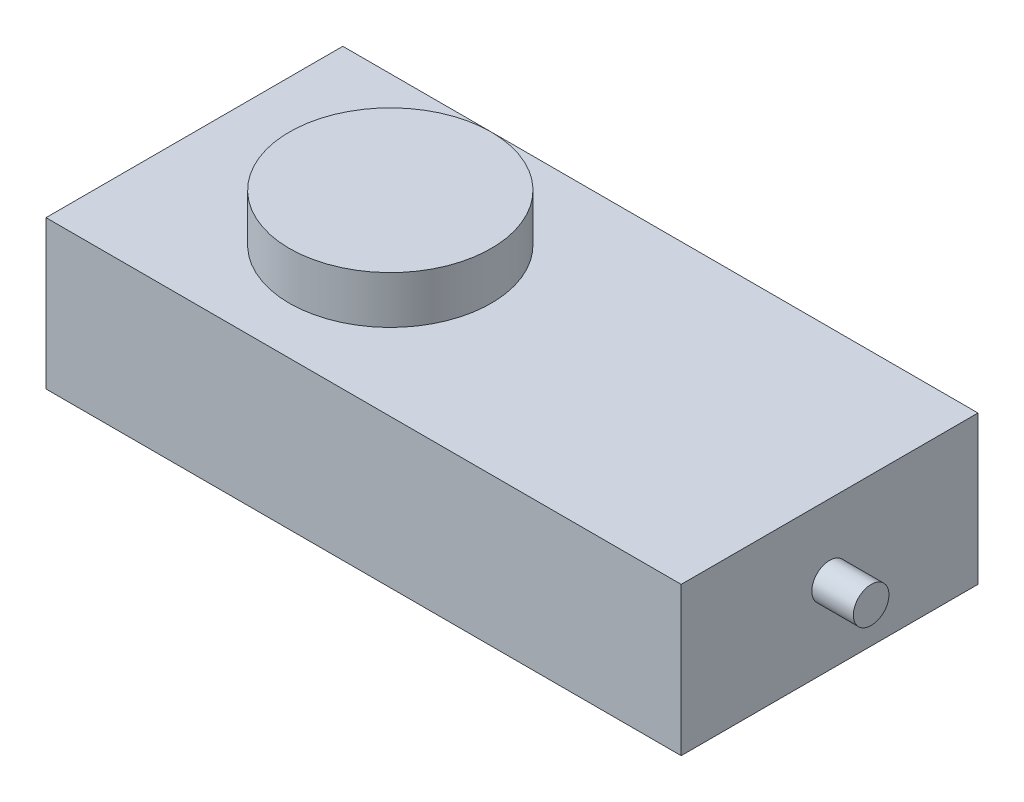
from build123d import *

# Parameters (mm, degrees)
SKETCH1_W           = 107
SKETCH1_H           = 50
BOSS_EXTRUDE1_DEPTH = 25
SKETCH2_R           = 17
BOSS_EXTRUDE2_DEPTH = 8
SKETCH3_R           = 3
BOSS_EXTRUDE3_DEPTH = 7


with BuildPart() as part:
    # Sketch1 → Boss-Extrude1 (new body)
    with BuildSketch(Plane(origin=(0, 0, 0), x_dir=(1, 0, 0), z_dir=(0, 1, 0))):
        Rectangle(SKETCH1_W, SKETCH1_H)
    extrude(amount=BOSS_EXTRUDE1_DEPTH)

    # Sketch2 → Boss-Extrude2 (add)
    with BuildSketch(Plane(origin=(0, 25, 0), x_dir=(1, 0, 0), z_dir=(0, 1, 0))):
        with Locations(Location((-20.5, 0, 0), (0, 0, 270))):
            Circle(SKETCH2_R)
    extrude(amount=BOSS_EXTRUDE2_DEPTH)

    # Sketch3 → Boss-Extrude3 (add)
    with BuildSketch(Plane(origin=(53.5, 0, 0), x_dir=(0, 0, -1), z_dir=(1, 0, 0))):
        with Locations(Location((0, 13, 0), (0, 0, 180))):
            Circle(SKETCH3_R)
    extrude(amount=BOSS_EXTRUDE3_DEPTH)


solid = part.part
